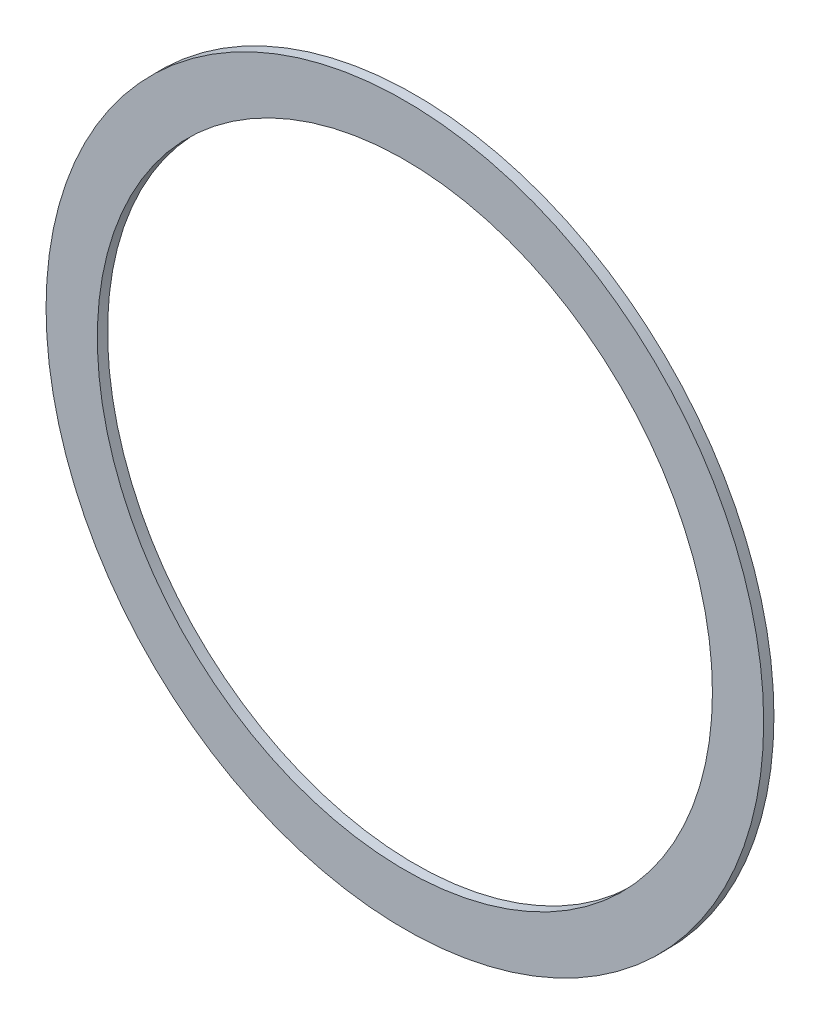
from build123d import *

# Parameters (mm, degrees)
ESQUISSE1_R      = 17.5
ESQUISSE1_R_2    = 15
EXTRUSION1_DEPTH = 0.5


with BuildPart() as part:
    # Esquisse1 → Extrusion1 (new body)
    with BuildSketch(Plane.XY):
        Circle(ESQUISSE1_R)
        Circle(ESQUISSE1_R_2, mode=Mode.SUBTRACT)
    extrude(amount=EXTRUSION1_DEPTH)


solid = part.part
